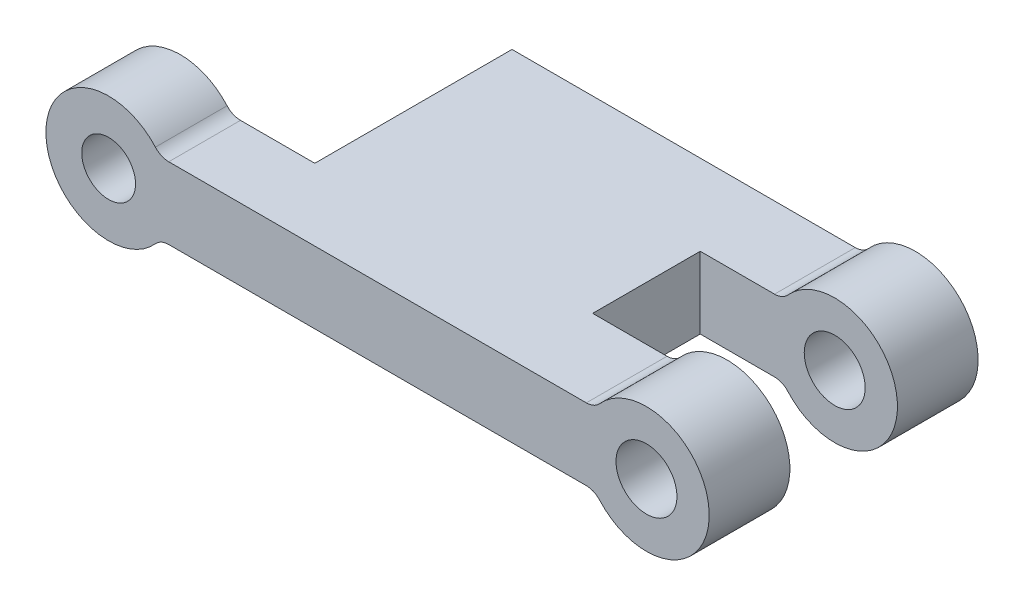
from build123d import *

# Parameters (mm, degrees)
SKETCH1_R            = 1.5
BOSS_EXTRUDE1_DEPTH  = 4
SKETCH2_W            = 15
SKETCH2_H            = 4
BOSS_EXTRUDE2_DEPTH  = 11
BOSS_EXTRUDE3_DEPTH  = 4.5
BOSS_EXTRUDE4_START  = 0.5
BOSS_EXTRUDE4_DEPTH  = 0.5
M3_CLEARANCE_HOLE1_D = 3.4


with BuildPart() as part:
    # Sketch1 → Boss-Extrude1 (new body)
    with BuildSketch(Plane.XY):
        with BuildLine():
            Line((26.645898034, 2), (3.354101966, 2))
            ThreePointArc((3.354101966, 2), (2.945853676, 2.087129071), (2.608745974, 2.333333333))
            ThreePointArc((2.608745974, 2.333333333), (-3.5, 0), (2.608745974, -2.333333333))
            ThreePointArc((2.608745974, -2.333333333), (2.945853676, -2.087129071), (3.354101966, -2))
            Line((3.354101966, -2), (26.645898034, -2))
            ThreePointArc((26.645898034, -2), (27.054146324, -2.087129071), (27.391254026, -2.333333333))
            ThreePointArc((27.391254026, -2.333333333), (33.5, 0), (27.391254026, 2.333333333))
            ThreePointArc((27.391254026, 2.333333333), (27.054146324, 2.087129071), (26.645898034, 2))
        make_face()
        Circle(SKETCH1_R, mode=Mode.SUBTRACT)
    extrude(amount=BOSS_EXTRUDE1_DEPTH)

    # Sketch2 → Boss-Extrude2 (add)
    with BuildSketch(Plane(origin=(0, 0, 0), x_dir=(-1, 0, 0), z_dir=(0, 0, -1))):
        with Locations((-15, 0)):
            Rectangle(SKETCH2_W, SKETCH2_H)
    extrude(amount=BOSS_EXTRUDE2_DEPTH)

    # Sketch3 → Boss-Extrude3 (add)
    with BuildSketch(Plane(origin=(0, 0, -11), x_dir=(-1, 0, 0), z_dir=(0, 0, -1))):
        with BuildLine():
            Line((-22.5, 2), (-22.5, -2))
            Line((-22.5, -2), (-26.645898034, -2))
            ThreePointArc((-26.645898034, -2), (-27.054146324, -2.087129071), (-27.391254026, -2.333333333))
            ThreePointArc((-27.391254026, -2.333333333), (-33.5, 0), (-27.391254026, 2.333333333))
            ThreePointArc((-27.391254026, 2.333333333), (-27.054146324, 2.087129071), (-26.645898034, 2))
            Line((-26.645898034, 2), (-22.5, 2))
        make_face()
    extrude(amount=-BOSS_EXTRUDE3_DEPTH)

    # Sketch4 → Boss-Extrude4 (add)
    with BuildSketch(Plane(origin=(0, 0, 0), x_dir=(-1, 0, 0), z_dir=(0, 0, -1)).offset(BOSS_EXTRUDE4_START)):
        with BuildLine():
            Line((-22.5, 2), (-22.5, -2))
            Line((-22.5, -2), (-26.645898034, -2))
            ThreePointArc((-26.645898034, -2), (-27.054146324, -2.087129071), (-27.391254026, -2.333333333))
            ThreePointArc((-27.391254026, -2.333333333), (-33.5, 0), (-27.391254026, 2.333333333))
            ThreePointArc((-27.391254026, 2.333333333), (-27.054146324, 2.087129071), (-26.645898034, 2))
            Line((-26.645898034, 2), (-22.5, 2))
        make_face()
    extrude(amount=-BOSS_EXTRUDE4_DEPTH)

    # M3 Clearance Hole1 (through all)
    with Locations(Plane.XY.offset(4)):
        with Locations((30, 0)):
            Hole(M3_CLEARANCE_HOLE1_D / 2)


solid = part.part
